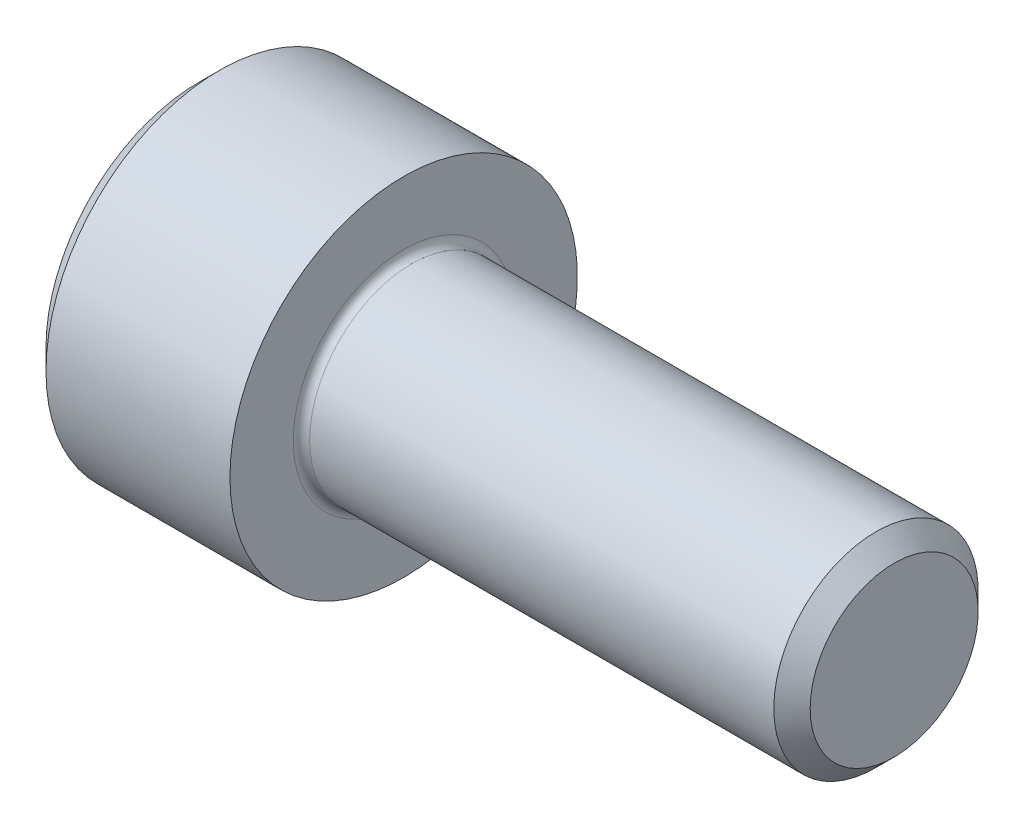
ISO-10303-21;
HEADER;
FILE_DESCRIPTION(('STEP AP214'),'2;1');
FILE_NAME('part.step','',(''),(''),'','','');
FILE_SCHEMA(('AUTOMOTIVE_DESIGN { 1 0 10303 214 1 1 1 1 }'));
ENDSEC;
DATA;
#1=APPLICATION_CONTEXT('core data for automotive mechanical design processes');
#2=APPLICATION_PROTOCOL_DEFINITION('international standard','automotive_design',2000,#1);
#3=PRODUCT_CONTEXT('',#1,'mechanical');
#4=PRODUCT('Part','Part','',(#3));
#5=PRODUCT_RELATED_PRODUCT_CATEGORY('part','',(#4));
#6=PRODUCT_DEFINITION_FORMATION('','',#4);
#7=PRODUCT_DEFINITION_CONTEXT('part definition',#1,'design');
#8=PRODUCT_DEFINITION('design','',#6,#7);
#9=PRODUCT_DEFINITION_SHAPE('','',#8);
#10=(LENGTH_UNIT() NAMED_UNIT(*) SI_UNIT(.MILLI.,.METRE.));
#11=(NAMED_UNIT(*) PLANE_ANGLE_UNIT() SI_UNIT($,.RADIAN.));
#12=(NAMED_UNIT(*) SI_UNIT($,.STERADIAN.) SOLID_ANGLE_UNIT());
#13=UNCERTAINTY_MEASURE_WITH_UNIT(LENGTH_MEASURE(1.E-05),#10,'distance_accuracy_value','');
#14=(GEOMETRIC_REPRESENTATION_CONTEXT(3) GLOBAL_UNCERTAINTY_ASSIGNED_CONTEXT((#13)) GLOBAL_UNIT_ASSIGNED_CONTEXT((#10,
#11,#12)) REPRESENTATION_CONTEXT('',''));
#15=CARTESIAN_POINT('',(0.,0.,0.));
#16=DIRECTION('',(0.,0.,1.));
#17=DIRECTION('',(1.,0.,0.));
#18=AXIS2_PLACEMENT_3D('',#15,#16,#17);
#19=CARTESIAN_POINT('',(0.,0.,0.));
#20=DIRECTION('',(-1.,0.,0.));
#21=DIRECTION('',(0.,0.,1.));
#22=AXIS2_PLACEMENT_3D('',#19,#20,#21);
#23=PLANE('',#22);
#24=DIRECTION('',(0.,-0.499999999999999,0.866025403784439));
#25=VECTOR('',#24,1.);
#26=CARTESIAN_POINT('',(0.,2.35789849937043,0.));
#27=LINE('',#26,#25);
#28=CARTESIAN_POINT('',(0.,2.35789849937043,0.));
#29=VERTEX_POINT('',#28);
#30=CARTESIAN_POINT('',(0.,1.17894924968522,2.042));
#31=VERTEX_POINT('',#30);
#32=EDGE_CURVE('E112',#29,#31,#27,.T.);
#33=ORIENTED_EDGE('',*,*,#32,.T.);
#34=DIRECTION('',(0.,1.,0.));
#35=VECTOR('',#34,1.);
#36=CARTESIAN_POINT('',(0.,-1.17894924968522,2.042));
#37=LINE('',#36,#35);
#38=CARTESIAN_POINT('',(0.,-1.17894924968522,2.042));
#39=VERTEX_POINT('',#38);
#40=EDGE_CURVE('E101',#39,#31,#37,.T.);
#41=ORIENTED_EDGE('',*,*,#40,.F.);
#42=DIRECTION('',(0.,-0.500000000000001,-0.866025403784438));
#43=VECTOR('',#42,1.);
#44=CARTESIAN_POINT('',(0.,-1.17894924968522,2.042));
#45=LINE('',#44,#43);
#46=CARTESIAN_POINT('',(0.,-2.35789849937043,0.));
#47=VERTEX_POINT('',#46);
#48=EDGE_CURVE('E111',#39,#47,#45,.T.);
#49=ORIENTED_EDGE('',*,*,#48,.T.);
#50=DIRECTION('',(0.,0.499999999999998,-0.86602540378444));
#51=VECTOR('',#50,1.);
#52=CARTESIAN_POINT('',(0.,-2.35789849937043,0.));
#53=LINE('',#52,#51);
#54=CARTESIAN_POINT('',(0.,-1.17894924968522,-2.042));
#55=VERTEX_POINT('',#54);
#56=EDGE_CURVE('E130',#47,#55,#53,.T.);
#57=ORIENTED_EDGE('',*,*,#56,.T.);
#58=DIRECTION('',(0.,-1.,0.));
#59=VECTOR('',#58,1.);
#60=CARTESIAN_POINT('',(0.,1.17894924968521,-2.042));
#61=LINE('',#60,#59);
#62=CARTESIAN_POINT('',(0.,1.17894924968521,-2.042));
#63=VERTEX_POINT('',#62);
#64=EDGE_CURVE('E133',#63,#55,#61,.T.);
#65=ORIENTED_EDGE('',*,*,#64,.F.);
#66=DIRECTION('',(0.,-0.500000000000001,-0.866025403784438));
#67=VECTOR('',#66,1.);
#68=CARTESIAN_POINT('',(0.,2.35789849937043,0.));
#69=LINE('',#68,#67);
#70=EDGE_CURVE('E126',#29,#63,#69,.T.);
#71=ORIENTED_EDGE('',*,*,#70,.F.);
#72=EDGE_LOOP('',(#33,#41,#49,#57,#65,#71));
#73=FACE_BOUND('',#72,.T.);
#74=CARTESIAN_POINT('',(0.,0.,0.));
#75=DIRECTION('',(-1.,0.,0.));
#76=DIRECTION('',(0.,0.,1.));
#77=AXIS2_PLACEMENT_3D('',#74,#75,#76);
#78=CIRCLE('',#77,3.75);
#79=CARTESIAN_POINT('',(0.,0.,3.75));
#80=VERTEX_POINT('',#79);
#81=EDGE_CURVE('E184',#80,#80,#78,.T.);
#82=ORIENTED_EDGE('',*,*,#81,.T.);
#83=EDGE_LOOP('',(#82));
#84=FACE_BOUND('',#83,.T.);
#85=ADVANCED_FACE('F30',(#73,#84),#23,.T.);
#86=CARTESIAN_POINT('',(0.,0.,0.));
#87=DIRECTION('',(1.,0.,0.));
#88=DIRECTION('',(0.,0.,-1.));
#89=AXIS2_PLACEMENT_3D('',#86,#87,#88);
#90=CONICAL_SURFACE('',#89,3.75,0.785398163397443);
#91=CARTESIAN_POINT('',(0.5,0.,0.));
#92=DIRECTION('',(-1.,0.,0.));
#93=DIRECTION('',(0.,0.,1.));
#94=AXIS2_PLACEMENT_3D('',#91,#92,#93);
#95=CIRCLE('',#94,4.25);
#96=CARTESIAN_POINT('',(0.5,0.,4.25));
#97=VERTEX_POINT('',#96);
#98=EDGE_CURVE('E181',#97,#97,#95,.T.);
#99=ORIENTED_EDGE('',*,*,#98,.T.);
#100=EDGE_LOOP('',(#99));
#101=FACE_BOUND('',#100,.T.);
#102=ORIENTED_EDGE('',*,*,#81,.F.);
#103=EDGE_LOOP('',(#102));
#104=FACE_BOUND('',#103,.T.);
#105=ADVANCED_FACE('F208',(#101,#104),#90,.T.);
#106=CARTESIAN_POINT('',(-31.75,0.,0.));
#107=DIRECTION('',(-1.,0.,0.));
#108=DIRECTION('',(0.,0.,1.));
#109=AXIS2_PLACEMENT_3D('',#106,#107,#108);
#110=CYLINDRICAL_SURFACE('',#109,4.25);
#111=CARTESIAN_POINT('',(5.,0.,0.));
#112=DIRECTION('',(-1.,0.,0.));
#113=DIRECTION('',(0.,0.,1.));
#114=AXIS2_PLACEMENT_3D('',#111,#112,#113);
#115=CIRCLE('',#114,4.25);
#116=CARTESIAN_POINT('',(5.,0.,4.25));
#117=VERTEX_POINT('',#116);
#118=EDGE_CURVE('E178',#117,#117,#115,.T.);
#119=ORIENTED_EDGE('',*,*,#118,.T.);
#120=EDGE_LOOP('',(#119));
#121=FACE_BOUND('',#120,.T.);
#122=ORIENTED_EDGE('',*,*,#98,.F.);
#123=EDGE_LOOP('',(#122));
#124=FACE_BOUND('',#123,.T.);
#125=ADVANCED_FACE('F212',(#121,#124),#110,.T.);
#126=CARTESIAN_POINT('',(5.,4.25,0.));
#127=DIRECTION('',(1.,0.,0.));
#128=DIRECTION('',(0.,0.,-1.));
#129=AXIS2_PLACEMENT_3D('',#126,#127,#128);
#130=PLANE('',#129);
#131=CARTESIAN_POINT('',(5.,0.,0.));
#132=DIRECTION('',(1.,0.,0.));
#133=DIRECTION('',(0.,0.,-1.));
#134=AXIS2_PLACEMENT_3D('',#131,#132,#133);
#135=CIRCLE('',#134,2.7);
#136=CARTESIAN_POINT('',(5.,0.,-2.7));
#137=VERTEX_POINT('',#136);
#138=EDGE_CURVE('E37',#137,#137,#135,.F.);
#139=ORIENTED_EDGE('',*,*,#138,.T.);
#140=EDGE_LOOP('',(#139));
#141=FACE_BOUND('',#140,.T.);
#142=ORIENTED_EDGE('',*,*,#118,.F.);
#143=EDGE_LOOP('',(#142));
#144=FACE_BOUND('',#143,.T.);
#145=ADVANCED_FACE('F189',(#141,#144),#130,.T.);
#146=CARTESIAN_POINT('',(-31.75,0.,0.));
#147=DIRECTION('',(-1.,0.,0.));
#148=DIRECTION('',(0.,0.,1.));
#149=AXIS2_PLACEMENT_3D('',#146,#147,#148);
#150=CYLINDRICAL_SURFACE('',#149,2.5);
#151=CARTESIAN_POINT('',(5.2,0.,0.));
#152=DIRECTION('',(1.,0.,0.));
#153=DIRECTION('',(0.,0.,-1.));
#154=AXIS2_PLACEMENT_3D('',#151,#152,#153);
#155=CIRCLE('',#154,2.5);
#156=CARTESIAN_POINT('',(5.2,0.,-2.5));
#157=VERTEX_POINT('',#156);
#158=EDGE_CURVE('E11',#157,#157,#155,.T.);
#159=ORIENTED_EDGE('',*,*,#158,.T.);
#160=EDGE_LOOP('',(#159));
#161=FACE_BOUND('',#160,.T.);
#162=CARTESIAN_POINT('',(16.555,0.,0.));
#163=DIRECTION('',(-1.,0.,0.));
#164=DIRECTION('',(0.,0.,1.));
#165=AXIS2_PLACEMENT_3D('',#162,#163,#164);
#166=CIRCLE('',#165,2.5);
#167=CARTESIAN_POINT('',(16.555,0.,2.5));
#168=VERTEX_POINT('',#167);
#169=EDGE_CURVE('E175',#168,#168,#166,.T.);
#170=ORIENTED_EDGE('',*,*,#169,.T.);
#171=EDGE_LOOP('',(#170));
#172=FACE_BOUND('',#171,.T.);
#173=ADVANCED_FACE('F223',(#161,#172),#150,.T.);
#174=CARTESIAN_POINT('',(17.,0.,0.));
#175=DIRECTION('',(-1.,0.,0.));
#176=DIRECTION('',(0.,0.,1.));
#177=AXIS2_PLACEMENT_3D('',#174,#175,#176);
#178=CONICAL_SURFACE('',#177,2.055,0.785398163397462);
#179=ORIENTED_EDGE('',*,*,#169,.F.);
#180=EDGE_LOOP('',(#179));
#181=FACE_BOUND('',#180,.T.);
#182=CARTESIAN_POINT('',(17.,0.,0.));
#183=DIRECTION('',(-1.,0.,0.));
#184=DIRECTION('',(0.,0.,1.));
#185=AXIS2_PLACEMENT_3D('',#182,#183,#184);
#186=CIRCLE('',#185,2.055);
#187=CARTESIAN_POINT('',(17.,0.,2.055));
#188=VERTEX_POINT('',#187);
#189=EDGE_CURVE('E171',#188,#188,#186,.T.);
#190=ORIENTED_EDGE('',*,*,#189,.T.);
#191=EDGE_LOOP('',(#190));
#192=FACE_BOUND('',#191,.T.);
#193=ADVANCED_FACE('F202',(#181,#192),#178,.T.);
#194=CARTESIAN_POINT('',(17.,2.055,0.));
#195=DIRECTION('',(1.,0.,0.));
#196=DIRECTION('',(0.,0.,-1.));
#197=AXIS2_PLACEMENT_3D('',#194,#195,#196);
#198=PLANE('',#197);
#199=ORIENTED_EDGE('',*,*,#189,.F.);
#200=EDGE_LOOP('',(#199));
#201=FACE_BOUND('',#200,.T.);
#202=ADVANCED_FACE('F194',(#201),#198,.T.);
#203=CARTESIAN_POINT('',(5.2,0.,0.));
#204=DIRECTION('',(1.,0.,0.));
#205=DIRECTION('',(0.,0.,-1.));
#206=AXIS2_PLACEMENT_3D('',#203,#204,#205);
#207=TOROIDAL_SURFACE('',#206,2.7,0.2);
#208=ORIENTED_EDGE('',*,*,#158,.F.);
#209=EDGE_LOOP('',(#208));
#210=FACE_BOUND('',#209,.T.);
#211=ORIENTED_EDGE('',*,*,#138,.F.);
#212=EDGE_LOOP('',(#211));
#213=FACE_BOUND('',#212,.T.);
#214=ADVANCED_FACE('F192',(#210,#213),#207,.F.);
#215=CARTESIAN_POINT('',(2.5,2.35789849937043,0.));
#216=DIRECTION('',(0.,-0.866025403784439,-0.499999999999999));
#217=DIRECTION('',(0.,0.499999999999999,-0.866025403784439));
#218=AXIS2_PLACEMENT_3D('',#215,#216,#217);
#219=PLANE('',#218);
#220=ORIENTED_EDGE('',*,*,#32,.F.);
#221=DIRECTION('',(-1.,0.,0.));
#222=VECTOR('',#221,1.);
#223=CARTESIAN_POINT('',(2.5,2.35789849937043,0.));
#224=LINE('',#223,#222);
#225=CARTESIAN_POINT('',(2.5,2.35789849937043,0.));
#226=VERTEX_POINT('',#225);
#227=EDGE_CURVE('E156',#226,#29,#224,.T.);
#228=ORIENTED_EDGE('',*,*,#227,.F.);
#229=DIRECTION('',(0.,-0.499999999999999,0.866025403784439));
#230=VECTOR('',#229,1.);
#231=CARTESIAN_POINT('',(2.5,2.35789849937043,0.));
#232=LINE('',#231,#230);
#233=CARTESIAN_POINT('',(2.5,1.76842387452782,1.021));
#234=VERTEX_POINT('',#233);
#235=EDGE_CURVE('E136',#226,#234,#232,.T.);
#236=ORIENTED_EDGE('',*,*,#235,.T.);
#237=CARTESIAN_POINT('',(2.5,1.17894924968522,2.042));
#238=VERTEX_POINT('',#237);
#239=EDGE_CURVE('E120',#234,#238,#232,.T.);
#240=ORIENTED_EDGE('',*,*,#239,.T.);
#241=DIRECTION('',(-1.,0.,0.));
#242=VECTOR('',#241,1.);
#243=CARTESIAN_POINT('',(2.5,1.17894924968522,2.042));
#244=LINE('',#243,#242);
#245=EDGE_CURVE('E105',#238,#31,#244,.T.);
#246=ORIENTED_EDGE('',*,*,#245,.T.);
#247=EDGE_LOOP('',(#220,#228,#236,#240,#246));
#248=FACE_BOUND('',#247,.T.);
#249=ADVANCED_FACE('F116',(#248),#219,.T.);
#250=CARTESIAN_POINT('',(2.5,-1.17894924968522,2.042));
#251=DIRECTION('',(0.,0.,1.));
#252=DIRECTION('',(0.,-1.,0.));
#253=AXIS2_PLACEMENT_3D('',#250,#251,#252);
#254=PLANE('',#253);
#255=ORIENTED_EDGE('',*,*,#40,.T.);
#256=ORIENTED_EDGE('',*,*,#245,.F.);
#257=DIRECTION('',(0.,1.,0.));
#258=VECTOR('',#257,1.);
#259=CARTESIAN_POINT('',(2.5,-1.17894924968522,2.042));
#260=LINE('',#259,#258);
#261=CARTESIAN_POINT('',(2.5,0.,2.042));
#262=VERTEX_POINT('',#261);
#263=EDGE_CURVE('E138',#262,#238,#260,.T.);
#264=ORIENTED_EDGE('',*,*,#263,.F.);
#265=CARTESIAN_POINT('',(2.5,-1.17894924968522,2.042));
#266=VERTEX_POINT('',#265);
#267=EDGE_CURVE('E139',#266,#262,#260,.T.);
#268=ORIENTED_EDGE('',*,*,#267,.F.);
#269=DIRECTION('',(-1.,0.,0.));
#270=VECTOR('',#269,1.);
#271=CARTESIAN_POINT('',(2.5,-1.17894924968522,2.042));
#272=LINE('',#271,#270);
#273=EDGE_CURVE('E107',#266,#39,#272,.T.);
#274=ORIENTED_EDGE('',*,*,#273,.T.);
#275=EDGE_LOOP('',(#255,#256,#264,#268,#274));
#276=FACE_BOUND('',#275,.T.);
#277=ADVANCED_FACE('F103',(#276),#254,.F.);
#278=CARTESIAN_POINT('',(2.5,-1.17894924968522,2.042));
#279=DIRECTION('',(0.,0.866025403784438,-0.500000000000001));
#280=DIRECTION('',(0.,0.500000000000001,0.866025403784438));
#281=AXIS2_PLACEMENT_3D('',#278,#279,#280);
#282=PLANE('',#281);
#283=ORIENTED_EDGE('',*,*,#48,.F.);
#284=ORIENTED_EDGE('',*,*,#273,.F.);
#285=DIRECTION('',(0.,-0.500000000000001,-0.866025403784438));
#286=VECTOR('',#285,1.);
#287=CARTESIAN_POINT('',(2.5,-1.17894924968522,2.042));
#288=LINE('',#287,#286);
#289=CARTESIAN_POINT('',(2.5,-1.76842387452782,1.021));
#290=VERTEX_POINT('',#289);
#291=EDGE_CURVE('E143',#266,#290,#288,.T.);
#292=ORIENTED_EDGE('',*,*,#291,.T.);
#293=CARTESIAN_POINT('',(2.5,-2.35789849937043,0.));
#294=VERTEX_POINT('',#293);
#295=EDGE_CURVE('E142',#290,#294,#288,.T.);
#296=ORIENTED_EDGE('',*,*,#295,.T.);
#297=DIRECTION('',(-1.,0.,0.));
#298=VECTOR('',#297,1.);
#299=CARTESIAN_POINT('',(2.5,-2.35789849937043,0.));
#300=LINE('',#299,#298);
#301=EDGE_CURVE('E164',#294,#47,#300,.T.);
#302=ORIENTED_EDGE('',*,*,#301,.T.);
#303=EDGE_LOOP('',(#283,#284,#292,#296,#302));
#304=FACE_BOUND('',#303,.T.);
#305=ADVANCED_FACE('F277',(#304),#282,.T.);
#306=CARTESIAN_POINT('',(2.5,-2.35789849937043,0.));
#307=DIRECTION('',(0.,0.86602540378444,0.499999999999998));
#308=DIRECTION('',(0.,-0.499999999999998,0.86602540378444));
#309=AXIS2_PLACEMENT_3D('',#306,#307,#308);
#310=PLANE('',#309);
#311=ORIENTED_EDGE('',*,*,#56,.F.);
#312=ORIENTED_EDGE('',*,*,#301,.F.);
#313=DIRECTION('',(0.,0.499999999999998,-0.86602540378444));
#314=VECTOR('',#313,1.);
#315=CARTESIAN_POINT('',(2.5,-2.35789849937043,0.));
#316=LINE('',#315,#314);
#317=CARTESIAN_POINT('',(2.5,-1.76842387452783,-1.021));
#318=VERTEX_POINT('',#317);
#319=EDGE_CURVE('E147',#294,#318,#316,.T.);
#320=ORIENTED_EDGE('',*,*,#319,.T.);
#321=CARTESIAN_POINT('',(2.5,-1.17894924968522,-2.042));
#322=VERTEX_POINT('',#321);
#323=EDGE_CURVE('E146',#318,#322,#316,.T.);
#324=ORIENTED_EDGE('',*,*,#323,.T.);
#325=DIRECTION('',(-1.,0.,0.));
#326=VECTOR('',#325,1.);
#327=CARTESIAN_POINT('',(2.5,-1.17894924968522,-2.042));
#328=LINE('',#327,#326);
#329=EDGE_CURVE('E161',#322,#55,#328,.T.);
#330=ORIENTED_EDGE('',*,*,#329,.T.);
#331=EDGE_LOOP('',(#311,#312,#320,#324,#330));
#332=FACE_BOUND('',#331,.T.);
#333=ADVANCED_FACE('F286',(#332),#310,.T.);
#334=CARTESIAN_POINT('',(2.5,1.17894924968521,-2.042));
#335=DIRECTION('',(0.,0.,-1.));
#336=DIRECTION('',(0.,1.,0.));
#337=AXIS2_PLACEMENT_3D('',#334,#335,#336);
#338=PLANE('',#337);
#339=ORIENTED_EDGE('',*,*,#64,.T.);
#340=ORIENTED_EDGE('',*,*,#329,.F.);
#341=DIRECTION('',(0.,-1.,0.));
#342=VECTOR('',#341,1.);
#343=CARTESIAN_POINT('',(2.5,1.17894924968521,-2.042));
#344=LINE('',#343,#342);
#345=CARTESIAN_POINT('',(2.5,0.,-2.042));
#346=VERTEX_POINT('',#345);
#347=EDGE_CURVE('E150',#346,#322,#344,.T.);
#348=ORIENTED_EDGE('',*,*,#347,.F.);
#349=CARTESIAN_POINT('',(2.5,1.17894924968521,-2.042));
#350=VERTEX_POINT('',#349);
#351=EDGE_CURVE('E44',#350,#346,#344,.T.);
#352=ORIENTED_EDGE('',*,*,#351,.F.);
#353=DIRECTION('',(-1.,0.,0.));
#354=VECTOR('',#353,1.);
#355=CARTESIAN_POINT('',(2.5,1.17894924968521,-2.042));
#356=LINE('',#355,#354);
#357=EDGE_CURVE('E158',#350,#63,#356,.T.);
#358=ORIENTED_EDGE('',*,*,#357,.T.);
#359=EDGE_LOOP('',(#339,#340,#348,#352,#358));
#360=FACE_BOUND('',#359,.T.);
#361=ADVANCED_FACE('F296',(#360),#338,.F.);
#362=CARTESIAN_POINT('',(2.5,2.35789849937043,0.));
#363=DIRECTION('',(0.,0.866025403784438,-0.500000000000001));
#364=DIRECTION('',(0.,0.500000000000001,0.866025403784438));
#365=AXIS2_PLACEMENT_3D('',#362,#363,#364);
#366=PLANE('',#365);
#367=ORIENTED_EDGE('',*,*,#70,.T.);
#368=ORIENTED_EDGE('',*,*,#357,.F.);
#369=DIRECTION('',(0.,-0.500000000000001,-0.866025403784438));
#370=VECTOR('',#369,1.);
#371=CARTESIAN_POINT('',(2.5,2.35789849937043,0.));
#372=LINE('',#371,#370);
#373=CARTESIAN_POINT('',(2.5,1.76842387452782,-1.021));
#374=VERTEX_POINT('',#373);
#375=EDGE_CURVE('E152',#374,#350,#372,.T.);
#376=ORIENTED_EDGE('',*,*,#375,.F.);
#377=EDGE_CURVE('E153',#226,#374,#372,.T.);
#378=ORIENTED_EDGE('',*,*,#377,.F.);
#379=ORIENTED_EDGE('',*,*,#227,.T.);
#380=EDGE_LOOP('',(#367,#368,#376,#378,#379));
#381=FACE_BOUND('',#380,.T.);
#382=ADVANCED_FACE('F306',(#381),#366,.F.);
#383=CARTESIAN_POINT('',(2.5,3.53684774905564,-2.04200000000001));
#384=DIRECTION('',(1.,0.,0.));
#385=DIRECTION('',(0.,0.,-1.));
#386=AXIS2_PLACEMENT_3D('',#383,#384,#385);
#387=PLANE('',#386);
#388=ORIENTED_EDGE('',*,*,#347,.T.);
#389=ORIENTED_EDGE('',*,*,#323,.F.);
#390=CARTESIAN_POINT('',(2.5,0.,0.));
#391=DIRECTION('',(-1.,0.,0.));
#392=DIRECTION('',(0.,0.,1.));
#393=AXIS2_PLACEMENT_3D('',#390,#391,#392);
#394=CIRCLE('',#393,2.042);
#395=EDGE_CURVE('E392',#346,#318,#394,.T.);
#396=ORIENTED_EDGE('',*,*,#395,.F.);
#397=EDGE_LOOP('',(#388,#389,#396));
#398=FACE_BOUND('',#397,.T.);
#399=ADVANCED_FACE('F316',(#398),#387,.F.);
#400=ORIENTED_EDGE('',*,*,#319,.F.);
#401=ORIENTED_EDGE('',*,*,#295,.F.);
#402=EDGE_CURVE('E390',#318,#290,#394,.T.);
#403=ORIENTED_EDGE('',*,*,#402,.F.);
#404=EDGE_LOOP('',(#400,#401,#403));
#405=FACE_BOUND('',#404,.T.);
#406=ADVANCED_FACE('F326',(#405),#387,.F.);
#407=ORIENTED_EDGE('',*,*,#291,.F.);
#408=ORIENTED_EDGE('',*,*,#267,.T.);
#409=EDGE_CURVE('E121',#290,#262,#394,.T.);
#410=ORIENTED_EDGE('',*,*,#409,.F.);
#411=EDGE_LOOP('',(#407,#408,#410));
#412=FACE_BOUND('',#411,.T.);
#413=ADVANCED_FACE('F337',(#412),#387,.F.);
#414=ORIENTED_EDGE('',*,*,#263,.T.);
#415=ORIENTED_EDGE('',*,*,#239,.F.);
#416=EDGE_CURVE('E168',#262,#234,#394,.T.);
#417=ORIENTED_EDGE('',*,*,#416,.F.);
#418=EDGE_LOOP('',(#414,#415,#417));
#419=FACE_BOUND('',#418,.T.);
#420=ADVANCED_FACE('F346',(#419),#387,.F.);
#421=ORIENTED_EDGE('',*,*,#235,.F.);
#422=ORIENTED_EDGE('',*,*,#377,.T.);
#423=EDGE_CURVE('E172',#234,#374,#394,.T.);
#424=ORIENTED_EDGE('',*,*,#423,.F.);
#425=EDGE_LOOP('',(#421,#422,#424));
#426=FACE_BOUND('',#425,.T.);
#427=ADVANCED_FACE('F355',(#426),#387,.F.);
#428=ORIENTED_EDGE('',*,*,#375,.T.);
#429=ORIENTED_EDGE('',*,*,#351,.T.);
#430=EDGE_CURVE('E395',#374,#346,#394,.T.);
#431=ORIENTED_EDGE('',*,*,#430,.F.);
#432=EDGE_LOOP('',(#428,#429,#431));
#433=FACE_BOUND('',#432,.T.);
#434=ADVANCED_FACE('F329',(#433),#387,.F.);
#435=CARTESIAN_POINT('',(2.5,0.,0.));
#436=DIRECTION('',(-1.,0.,0.));
#437=DIRECTION('',(0.,0.,1.));
#438=AXIS2_PLACEMENT_3D('',#435,#436,#437);
#439=CONICAL_SURFACE('',#438,2.042,1.04719755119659);
#440=CARTESIAN_POINT('',(3.67894924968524,0.,0.));
#441=VERTEX_POINT('',#440);
#442=VERTEX_LOOP('',#441);
#443=FACE_BOUND('',#442,.T.);
#444=ORIENTED_EDGE('',*,*,#416,.T.);
#445=ORIENTED_EDGE('',*,*,#423,.T.);
#446=ORIENTED_EDGE('',*,*,#430,.T.);
#447=ORIENTED_EDGE('',*,*,#395,.T.);
#448=ORIENTED_EDGE('',*,*,#402,.T.);
#449=ORIENTED_EDGE('',*,*,#409,.T.);
#450=EDGE_LOOP('',(#444,#445,#446,#447,#448,#449));
#451=FACE_BOUND('',#450,.T.);
#452=ADVANCED_FACE('F372',(#443,#451),#439,.F.);
#453=CLOSED_SHELL('',(#85,#105,#125,#145,#173,#193,#202,#214,#249,#277,#305,#333,#361,#382,#399,
#406,#413,#420,#427,#434,#452));
#454=MANIFOLD_SOLID_BREP('B2',#453);
#455=ADVANCED_BREP_SHAPE_REPRESENTATION('',(#18,#454),#14);
#456=SHAPE_DEFINITION_REPRESENTATION(#9,#455);
ENDSEC;
END-ISO-10303-21;
